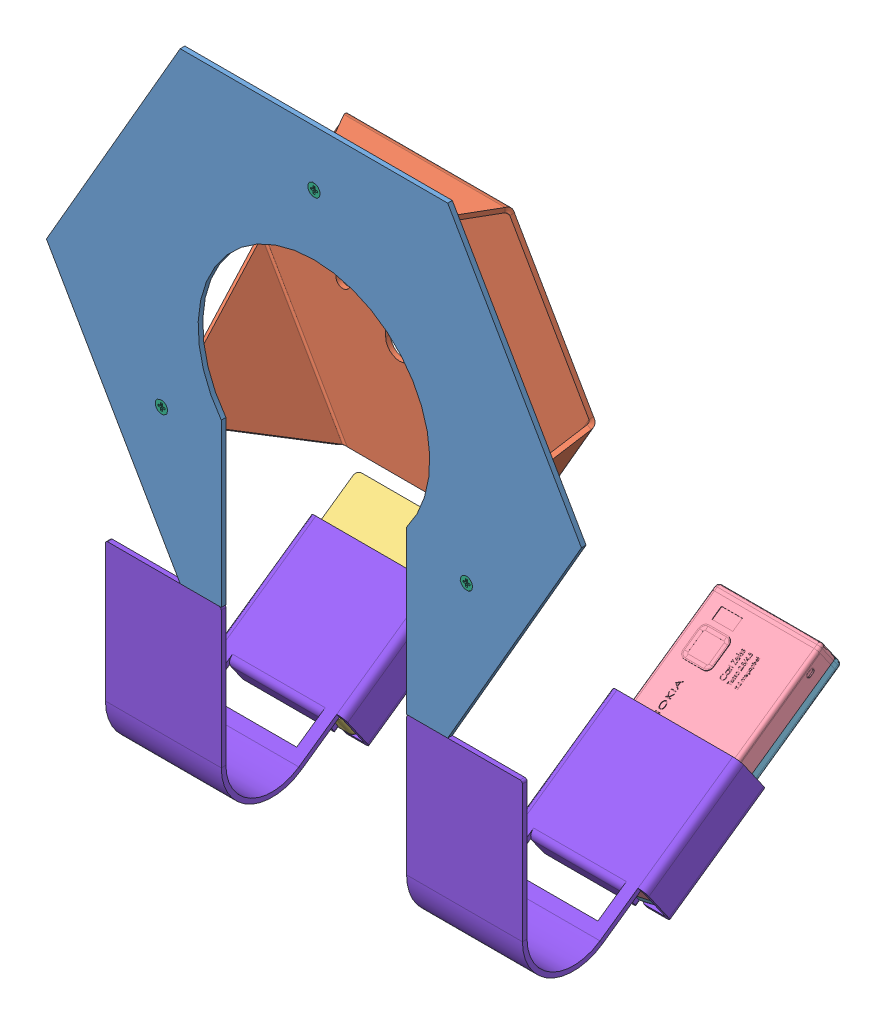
SolidWorks assembly Windmill Base Sub-Assembly.SLDASM, configuration Default (file format 4400). Lengths in mm.
Overall size (230.94 282.11 138.58).
14 component instances, 8 part files, 27 mates.
Components (placement in the parent):
- Base Sheet-1: Base Sheet.SLDPRT [Default] at (8.561 5.7799 -7.4443) size (230.94 200 2)
- Housing Base-1: Housing Base.SLDPRT [Default] at (8.5598 66.8276 -117.5648) x (-1 -0.000021 0) z (-0.000021 1 0) size (153.45 48.53 149.77)
- Speed Indicator-1: Speed Indicator.SLDPRT [Default] at (-55.439 -146.1832 -89.7387) x (-1 0 0) z (0 -0.819152 -0.573576) size (50 70 17.26)
- Nokia 6500-1: Nokia 6500.sldasm [Default] at (65.4701 -138.3548 -108.1577) x (-1 0 0) z (0 -0.819152 -0.573576) size (46.1 96 17.27)
  - NK Phone bottom keypad-1: NK Phone bottom keypad.SLDPRT [Default] at (-34.091 41.4219 -10.1521) size (46.1 96 11.75)
  - NK phone Top slide-1: NK phone Top slide.SLDPRT [Default] at (-34.091 41.4219 -0.1521) size (46 96 7.14)
- Countersunk Flat Head Cross Recess Screw ISO M3 X 8-1: Countersunk Flat Head Cross Recess Screw ISO M3 X 8.SLDPRT [ISO 7046-1 - M3 x 10 - Z --- 10N] at (74.379 -32.2201 -7.4443) x (0 0 -1) z (1 0 0) size (10 5.5 5.5)
- Countersunk Flat Head Cross Recess Screw ISO M3 X 8-2: Countersunk Flat Head Cross Recess Screw ISO M3 X 8.SLDPRT [ISO 7046-1 - M3 x 10 - Z --- 10N] at (8.561 81.7799 -7.4443) x (0 0 -1) z (1 0 0) size (10 5.5 5.5)
- Countersunk Flat Head Cross Recess Screw ISO M3 X 8-3: Countersunk Flat Head Cross Recess Screw ISO M3 X 8.SLDPRT [ISO 7046-1 - M3 x 10 - Z --- 10N] at (-57.2569 -32.2201 -7.4443) x (0 0 -1) z (1 0 0) size (10 5.5 5.5)
- Hex Nut Style 1 Grade AB ISO M3-1: Hex Nut Style 1 Grade AB ISO M3.SLDPRT [Hexagon Nut ISO - 4032 - M3 - W - N] at (74.379 -32.2201 -13.8443) x (-1 0 0) z (0 0 -1) size (5.5 6.35 2.4)
- Hex Nut Style 1 Grade AB ISO M3-2: Hex Nut Style 1 Grade AB ISO M3.SLDPRT [Hexagon Nut ISO - 4032 - M3 - W - N] at (-57.2569 -32.2201 -11.4443) size (5.5 6.35 2.4)
- Hex Nut Style 1 Grade AB ISO M3-3: Hex Nut Style 1 Grade AB ISO M3.SLDPRT [Hexagon Nut ISO - 4032 - M3 - W - N] at (8.561 81.7799 -11.4443) size (5.5 6.35 2.4)
- Phone Holder-1: Phone Holder.SLDPRT [Digitale snelheidsmeter] at (48.561 -94.2201 -9.4443) x (0 -1 0) z (1 0 0) size (82.11 102.86 56)
- Phone Holder-2: Phone Holder.SLDPRT [Digitale snelheidsmeter] at (-81.439 -94.2201 -9.4443) x (0 -1 0) z (1 0 0) size (82.11 102.86 56)
Mates (geometry in assembly coordinates):
- Coincident1: coincident anti-aligned: plane of Base Sheet-1 through (8.561 5.7799 -9.4443) normal (0 0 -1); plane of Housing Base-1 through (18.5613 68.8278 -9.4443) normal (0 0 1)
- Concentric1: concentric aligned: cylinder of Base Sheet-1 through (8.561 81.7799 -9.4443) axis (0 0 1) radius 1.6; cylinder of Housing Base-1 through (8.561 81.7799 -57.9765) axis (0 0 1) radius 1.6
- Concentric2: concentric aligned: cylinder of Base Sheet-1 through (-57.2569 -32.2201 -9.4443) axis (0 0 1) radius 1.6; cylinder of Housing Base-1 through (-57.2569 -32.2201 -57.9765) axis (0 0 1) radius 1.6
- Concentric3: concentric anti-aligned: circle of Base Sheet-1; circle of Countersunk Flat Head Cross Recess Screw ISO M3 X 8-3
- Coincident2: coincident aligned: plane of Base Sheet-1 through (8.561 5.7799 -7.4443) normal (0 0 1); plane of Countersunk Flat Head Cross Recess Screw ISO M3 X 8-3 through (-57.2569 -32.2201 -7.4443) normal (0 0 1)
- Concentric4: concentric anti-aligned: circle of Base Sheet-1; circle of Countersunk Flat Head Cross Recess Screw ISO M3 X 8-2
- Coincident3: coincident aligned: plane of Base Sheet-1 through (8.561 5.7799 -7.4443) normal (0 0 1); plane of Countersunk Flat Head Cross Recess Screw ISO M3 X 8-2 through (8.561 81.7799 -7.4443) normal (0 0 1)
- Concentric5: concentric anti-aligned: circle of Base Sheet-1; circle of Countersunk Flat Head Cross Recess Screw ISO M3 X 8-1
- Coincident4: coincident aligned: plane of Base Sheet-1 through (8.561 5.7799 -7.4443) normal (0 0 1); plane of Countersunk Flat Head Cross Recess Screw ISO M3 X 8-1 through (74.379 -32.2201 -7.4443) normal (0 0 1)
- Concentric6: concentric aligned: cylinder of Countersunk Flat Head Cross Recess Screw ISO M3 X 8-3 through (-57.2569 -32.2201 -1.0943) axis (0 0 1) radius 1.5; cylinder of Hex Nut Style 1 Grade AB ISO M3-2 through (-57.2569 -32.2201 -13.8443) axis (0 0 1) radius 1.25
- Coincident5: coincident anti-aligned: plane of Housing Base-1 through (-61.8242 -46.4048 -11.4443) normal (0 0 -1); plane of Hex Nut Style 1 Grade AB ISO M3-2 through (-57.2569 -29.0447 -11.4443) normal (0 0 1)
- Concentric7: concentric aligned: cylinder of Countersunk Flat Head Cross Recess Screw ISO M3 X 8-2 through (8.561 81.7799 -1.0943) axis (0 0 1) radius 1.5; cylinder of Hex Nut Style 1 Grade AB ISO M3-3 through (8.561 81.7799 -13.8443) axis (0 0 1) radius 1.25
- Coincident6: coincident anti-aligned: plane of Housing Base-1 through (18.5613 68.8278 -11.4443) normal (0 0 -1); plane of Hex Nut Style 1 Grade AB ISO M3-3 through (8.561 84.9553 -11.4443) normal (0 0 1)
- Concentric8: concentric anti-aligned: cylinder of Countersunk Flat Head Cross Recess Screw ISO M3 X 8-1 through (74.379 -32.2201 -1.0943) axis (0 0 1) radius 1.5; cylinder of Hex Nut Style 1 Grade AB ISO M3-1 through (74.379 -32.2201 -11.4443) axis (0 0 -1) radius 1.25
- Coincident7: coincident anti-aligned: plane of Housing Base-1 through (88.9465 -29.0834 -11.4443) normal (0 0 -1); plane of Hex Nut Style 1 Grade AB ISO M3-1 through (74.379 -29.0447 -11.4443) normal (0 0 1)
- Coincident8: coincident: plane of Base Sheet-1 through (-49.174 -94.2201 -9.4443) normal (0 -1 0); plane of Phone Holder-2 through (-31.439 -94.2201 -7.4443) normal (0 1 0)
- Coincident9: coincident: plane of Base Sheet-1 through (8.561 5.7799 -9.4443) normal (0 0 -1); plane of Phone Holder-2 through (-31.439 -94.2201 -9.4443) normal (0 0 -1)
- Coincident10: coincident aligned: plane of Base Sheet-1 through (-31.439 -94.2201 -9.4443) normal (1 0 0); plane of Phone Holder-2 through (-31.439 -154.2201 -29.4443) normal (1 0 0)
- Coincident11: coincident: plane of Base Sheet-1 through (48.561 -94.2201 -9.4443) normal (0 -1 0); plane of Phone Holder-1 through (98.561 -94.2201 -7.4443) normal (0 1 0)
- Coincident12: coincident: plane of Base Sheet-1 through (8.561 5.7799 -9.4443) normal (0 0 -1); plane of Phone Holder-1 through (98.561 -94.2201 -9.4443) normal (0 0 -1)
- Coincident13: coincident aligned: plane of Base Sheet-1 through (48.561 -94.2201 -9.4443) normal (-1 0 0); plane of Phone Holder-1 through (48.561 -172.2414 -42.063) normal (-1 0 0)
- Coincident14: coincident: plane of Nokia 6500-1/NK Phone bottom keypad-1 through (76.561 -109.9128 -131.0775) normal (0 0.819152 0.573576); plane of Phone Holder-1 through (98.561 -172.2414 -42.063) normal (0 -0.819152 -0.573576)
- Coincident15: coincident: plane of Nokia 6500-1/NK Phone bottom keypad-1 through (99.561 -114.4716 -142.0013) normal (1 0 0); plane of Phone Holder-1 through (99.561 -160.7699 -58.446) normal (-1 0 0)
- Tangent1: tangent anti-aligned: cylinder of Nokia 6500-1/NK Phone bottom keypad-1 through (76.561 -118.1043 -136.8133) axis (0 0.819152 0.573576) radius 89.6667; plane of Phone Holder-1 through (93.561 -161.3434 -57.6269) normal (0 0.573576 -0.819152)
- Coincident16: coincident: plane of Speed Indicator-1 through (-80.439 -121.1931 -114.9675) normal (0 0.819152 0.573576); plane of Phone Holder-2 through (-31.439 -172.2414 -42.063) normal (0 -0.819152 -0.573576)
- Coincident17: coincident: plane of Speed Indicator-1 through (-30.439 -27.3037 -6.4984) normal (1 0 0); plane of Phone Holder-2 through (-30.439 -160.7699 -58.446) normal (-1 0 0)
- Coincident18: coincident anti-aligned: plane of Speed Indicator-1 through (-80.439 -171.1733 -64.5098) normal (0 -0.573576 0.819152); plane of Phone Holder-2 through (-36.439 -161.3434 -57.6269) normal (0 0.573576 -0.819152)
